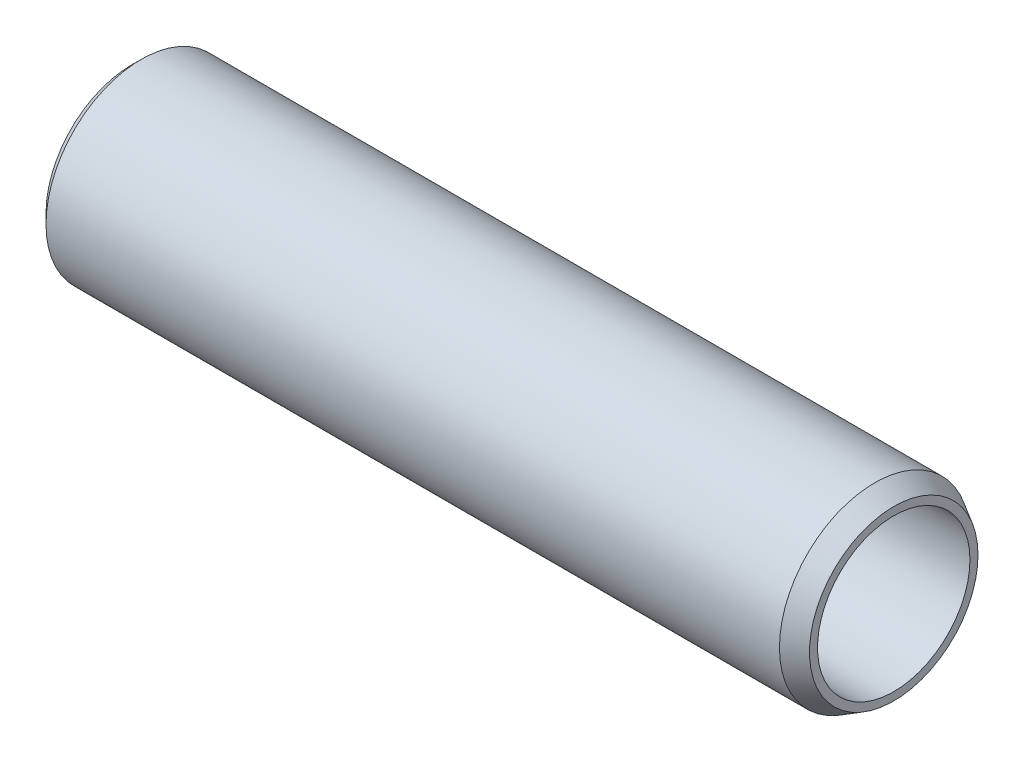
ISO-10303-21;
HEADER;
FILE_DESCRIPTION(('STEP AP214'),'2;1');
FILE_NAME('part.step','',(''),(''),'','','');
FILE_SCHEMA(('AUTOMOTIVE_DESIGN { 1 0 10303 214 1 1 1 1 }'));
ENDSEC;
DATA;
#1=APPLICATION_CONTEXT('core data for automotive mechanical design processes');
#2=APPLICATION_PROTOCOL_DEFINITION('international standard','automotive_design',2000,#1);
#3=PRODUCT_CONTEXT('',#1,'mechanical');
#4=PRODUCT('Part','Part','',(#3));
#5=PRODUCT_RELATED_PRODUCT_CATEGORY('part','',(#4));
#6=PRODUCT_DEFINITION_FORMATION('','',#4);
#7=PRODUCT_DEFINITION_CONTEXT('part definition',#1,'design');
#8=PRODUCT_DEFINITION('design','',#6,#7);
#9=PRODUCT_DEFINITION_SHAPE('','',#8);
#10=(LENGTH_UNIT() NAMED_UNIT(*) SI_UNIT(.MILLI.,.METRE.));
#11=(NAMED_UNIT(*) PLANE_ANGLE_UNIT() SI_UNIT($,.RADIAN.));
#12=(NAMED_UNIT(*) SI_UNIT($,.STERADIAN.) SOLID_ANGLE_UNIT());
#13=UNCERTAINTY_MEASURE_WITH_UNIT(LENGTH_MEASURE(1.E-05),#10,'distance_accuracy_value','');
#14=(GEOMETRIC_REPRESENTATION_CONTEXT(3) GLOBAL_UNCERTAINTY_ASSIGNED_CONTEXT((#13)) GLOBAL_UNIT_ASSIGNED_CONTEXT((#10,
#11,#12)) REPRESENTATION_CONTEXT('',''));
#15=CARTESIAN_POINT('',(0.,0.,0.));
#16=DIRECTION('',(0.,0.,1.));
#17=DIRECTION('',(1.,0.,0.));
#18=AXIS2_PLACEMENT_3D('',#15,#16,#17);
#19=CARTESIAN_POINT('',(-86.5,16.9999999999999,19.9999999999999));
#20=DIRECTION('',(-1.,0.,0.));
#21=DIRECTION('',(0.,0.,1.));
#22=AXIS2_PLACEMENT_3D('',#19,#20,#21);
#23=CONICAL_SURFACE('',#22,10.,0.523598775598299);
#24=CARTESIAN_POINT('',(-84.5,16.9999999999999,20.));
#25=DIRECTION('',(1.,0.,0.));
#26=DIRECTION('',(0.,0.,-1.));
#27=AXIS2_PLACEMENT_3D('',#24,#25,#26);
#28=CIRCLE('',#27,8.84529946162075);
#29=CARTESIAN_POINT('',(-84.5,16.9999999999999,11.1547005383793));
#30=VERTEX_POINT('',#29);
#31=EDGE_CURVE('E10',#30,#30,#28,.T.);
#32=ORIENTED_EDGE('',*,*,#31,.F.);
#33=EDGE_LOOP('',(#32));
#34=FACE_BOUND('',#33,.T.);
#35=CARTESIAN_POINT('',(-86.5,16.9999999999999,19.9999999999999));
#36=DIRECTION('',(1.,0.,0.));
#37=DIRECTION('',(0.,0.,-1.));
#38=AXIS2_PLACEMENT_3D('',#35,#36,#37);
#39=CIRCLE('',#38,10.);
#40=CARTESIAN_POINT('',(-86.5,16.9999999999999,9.99999999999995));
#41=VERTEX_POINT('',#40);
#42=EDGE_CURVE('E45',#41,#41,#39,.T.);
#43=ORIENTED_EDGE('',*,*,#42,.T.);
#44=EDGE_LOOP('',(#43));
#45=FACE_BOUND('',#44,.T.);
#46=ADVANCED_FACE('F14',(#34,#45),#23,.T.);
#47=CARTESIAN_POINT('',(-84.5,25.8452994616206,20.));
#48=DIRECTION('',(-1.,0.,0.));
#49=DIRECTION('',(0.,0.,1.));
#50=AXIS2_PLACEMENT_3D('',#47,#48,#49);
#51=PLANE('',#50);
#52=CARTESIAN_POINT('',(-84.5,16.9999999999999,20.));
#53=DIRECTION('',(1.,0.,0.));
#54=DIRECTION('',(0.,0.,-1.));
#55=AXIS2_PLACEMENT_3D('',#52,#53,#54);
#56=CIRCLE('',#55,8.);
#57=CARTESIAN_POINT('',(-84.5,16.9999999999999,12.));
#58=VERTEX_POINT('',#57);
#59=EDGE_CURVE('E20',#58,#58,#56,.T.);
#60=ORIENTED_EDGE('',*,*,#59,.F.);
#61=EDGE_LOOP('',(#60));
#62=FACE_BOUND('',#61,.T.);
#63=ORIENTED_EDGE('',*,*,#31,.T.);
#64=EDGE_LOOP('',(#63));
#65=FACE_BOUND('',#64,.T.);
#66=ADVANCED_FACE('F75',(#62,#65),#51,.F.);
#67=CARTESIAN_POINT('',(-84.5,16.9999999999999,20.));
#68=DIRECTION('',(1.,0.,0.));
#69=DIRECTION('',(0.,0.,-1.));
#70=AXIS2_PLACEMENT_3D('',#67,#68,#69);
#71=CYLINDRICAL_SURFACE('',#70,8.);
#72=CARTESIAN_POINT('',(-156.5,16.9999999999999,19.9999999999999));
#73=DIRECTION('',(1.,0.,0.));
#74=DIRECTION('',(0.,0.,-1.));
#75=AXIS2_PLACEMENT_3D('',#72,#73,#74);
#76=CIRCLE('',#75,8.);
#77=CARTESIAN_POINT('',(-156.5,16.9999999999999,11.9999999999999));
#78=VERTEX_POINT('',#77);
#79=EDGE_CURVE('E24',#78,#78,#76,.T.);
#80=ORIENTED_EDGE('',*,*,#79,.F.);
#81=EDGE_LOOP('',(#80));
#82=FACE_BOUND('',#81,.T.);
#83=ORIENTED_EDGE('',*,*,#59,.T.);
#84=EDGE_LOOP('',(#83));
#85=FACE_BOUND('',#84,.T.);
#86=ADVANCED_FACE('F80',(#82,#85),#71,.F.);
#87=CARTESIAN_POINT('',(-156.5,16.9999999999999,19.9999999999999));
#88=DIRECTION('',(1.,0.,0.));
#89=DIRECTION('',(0.,0.,-1.));
#90=AXIS2_PLACEMENT_3D('',#87,#88,#89);
#91=CONICAL_SURFACE('',#90,8.,1.22173047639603);
#92=CARTESIAN_POINT('',(-158.202129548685,16.9999999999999,20.0000000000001));
#93=DIRECTION('',(1.,0.,0.));
#94=DIRECTION('',(0.,0.,-1.));
#95=AXIS2_PLACEMENT_3D('',#92,#93,#94);
#96=CIRCLE('',#95,3.3234375);
#97=CARTESIAN_POINT('',(-158.202129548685,16.9999999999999,16.6765625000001));
#98=VERTEX_POINT('',#97);
#99=EDGE_CURVE('E28',#98,#98,#96,.T.);
#100=ORIENTED_EDGE('',*,*,#99,.F.);
#101=EDGE_LOOP('',(#100));
#102=FACE_BOUND('',#101,.T.);
#103=ORIENTED_EDGE('',*,*,#79,.T.);
#104=EDGE_LOOP('',(#103));
#105=FACE_BOUND('',#104,.T.);
#106=ADVANCED_FACE('F85',(#102,#105),#91,.F.);
#107=CARTESIAN_POINT('',(-84.5,16.9999999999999,20.));
#108=DIRECTION('',(1.,0.,0.));
#109=DIRECTION('',(0.,0.,-1.));
#110=AXIS2_PLACEMENT_3D('',#107,#108,#109);
#111=CYLINDRICAL_SURFACE('',#110,3.32343749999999);
#112=CARTESIAN_POINT('',(-163.5,16.9999999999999,20.0000000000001));
#113=DIRECTION('',(1.,0.,0.));
#114=DIRECTION('',(0.,0.,-1.));
#115=AXIS2_PLACEMENT_3D('',#112,#113,#114);
#116=CIRCLE('',#115,3.32343749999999);
#117=CARTESIAN_POINT('',(-163.5,16.9999999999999,16.6765625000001));
#118=VERTEX_POINT('',#117);
#119=EDGE_CURVE('E33',#118,#118,#116,.T.);
#120=ORIENTED_EDGE('',*,*,#119,.F.);
#121=EDGE_LOOP('',(#120));
#122=FACE_BOUND('',#121,.T.);
#123=ORIENTED_EDGE('',*,*,#99,.T.);
#124=EDGE_LOOP('',(#123));
#125=FACE_BOUND('',#124,.T.);
#126=ADVANCED_FACE('F71',(#122,#125),#111,.F.);
#127=CARTESIAN_POINT('',(-163.5,16.9999999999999,20.0000000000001));
#128=DIRECTION('',(-1.,0.,0.));
#129=DIRECTION('',(0.,0.,1.));
#130=AXIS2_PLACEMENT_3D('',#127,#128,#129);
#131=CONICAL_SURFACE('',#130,3.32343749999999,0.78539816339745);
#132=CARTESIAN_POINT('',(-164.5,16.9999999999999,20.0000000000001));
#133=DIRECTION('',(1.,0.,0.));
#134=DIRECTION('',(0.,0.,-1.));
#135=AXIS2_PLACEMENT_3D('',#132,#133,#134);
#136=CIRCLE('',#135,4.32343749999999);
#137=CARTESIAN_POINT('',(-164.5,16.9999999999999,15.6765625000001));
#138=VERTEX_POINT('',#137);
#139=EDGE_CURVE('E36',#138,#138,#136,.T.);
#140=ORIENTED_EDGE('',*,*,#139,.F.);
#141=EDGE_LOOP('',(#140));
#142=FACE_BOUND('',#141,.T.);
#143=ORIENTED_EDGE('',*,*,#119,.T.);
#144=EDGE_LOOP('',(#143));
#145=FACE_BOUND('',#144,.T.);
#146=ADVANCED_FACE('F64',(#142,#145),#131,.F.);
#147=CARTESIAN_POINT('',(-164.5,26.,20.0000000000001));
#148=DIRECTION('',(-1.,0.,0.));
#149=DIRECTION('',(0.,0.,1.));
#150=AXIS2_PLACEMENT_3D('',#147,#148,#149);
#151=PLANE('',#150);
#152=ORIENTED_EDGE('',*,*,#139,.T.);
#153=EDGE_LOOP('',(#152));
#154=FACE_BOUND('',#153,.T.);
#155=CARTESIAN_POINT('',(-164.5,16.9999999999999,20.0000000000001));
#156=DIRECTION('',(1.,0.,0.));
#157=DIRECTION('',(0.,0.,-1.));
#158=AXIS2_PLACEMENT_3D('',#155,#156,#157);
#159=CIRCLE('',#158,9.);
#160=CARTESIAN_POINT('',(-164.5,16.9999999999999,11.0000000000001));
#161=VERTEX_POINT('',#160);
#162=EDGE_CURVE('E39',#161,#161,#159,.T.);
#163=ORIENTED_EDGE('',*,*,#162,.F.);
#164=EDGE_LOOP('',(#163));
#165=FACE_BOUND('',#164,.T.);
#166=ADVANCED_FACE('F59',(#154,#165),#151,.T.);
#167=CARTESIAN_POINT('',(-164.5,16.9999999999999,20.0000000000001));
#168=DIRECTION('',(1.,0.,0.));
#169=DIRECTION('',(0.,0.,-1.));
#170=AXIS2_PLACEMENT_3D('',#167,#168,#169);
#171=CONICAL_SURFACE('',#170,9.,0.785398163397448);
#172=CARTESIAN_POINT('',(-163.5,16.9999999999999,20.0000000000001));
#173=DIRECTION('',(1.,0.,0.));
#174=DIRECTION('',(0.,0.,-1.));
#175=AXIS2_PLACEMENT_3D('',#172,#173,#174);
#176=CIRCLE('',#175,10.);
#177=CARTESIAN_POINT('',(-163.5,16.9999999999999,10.0000000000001));
#178=VERTEX_POINT('',#177);
#179=EDGE_CURVE('E42',#178,#178,#176,.T.);
#180=ORIENTED_EDGE('',*,*,#179,.F.);
#181=EDGE_LOOP('',(#180));
#182=FACE_BOUND('',#181,.T.);
#183=ORIENTED_EDGE('',*,*,#162,.T.);
#184=EDGE_LOOP('',(#183));
#185=FACE_BOUND('',#184,.T.);
#186=ADVANCED_FACE('F53',(#182,#185),#171,.T.);
#187=CARTESIAN_POINT('',(-84.5,16.9999999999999,20.));
#188=DIRECTION('',(1.,0.,0.));
#189=DIRECTION('',(0.,0.,-1.));
#190=AXIS2_PLACEMENT_3D('',#187,#188,#189);
#191=CYLINDRICAL_SURFACE('',#190,10.);
#192=ORIENTED_EDGE('',*,*,#42,.F.);
#193=EDGE_LOOP('',(#192));
#194=FACE_BOUND('',#193,.T.);
#195=ORIENTED_EDGE('',*,*,#179,.T.);
#196=EDGE_LOOP('',(#195));
#197=FACE_BOUND('',#196,.T.);
#198=ADVANCED_FACE('F50',(#194,#197),#191,.T.);
#199=CLOSED_SHELL('',(#46,#66,#86,#106,#126,#146,#166,#186,#198));
#200=MANIFOLD_SOLID_BREP('B1',#199);
#201=ADVANCED_BREP_SHAPE_REPRESENTATION('',(#18,#200),#14);
#202=SHAPE_DEFINITION_REPRESENTATION(#9,#201);
ENDSEC;
END-ISO-10303-21;
